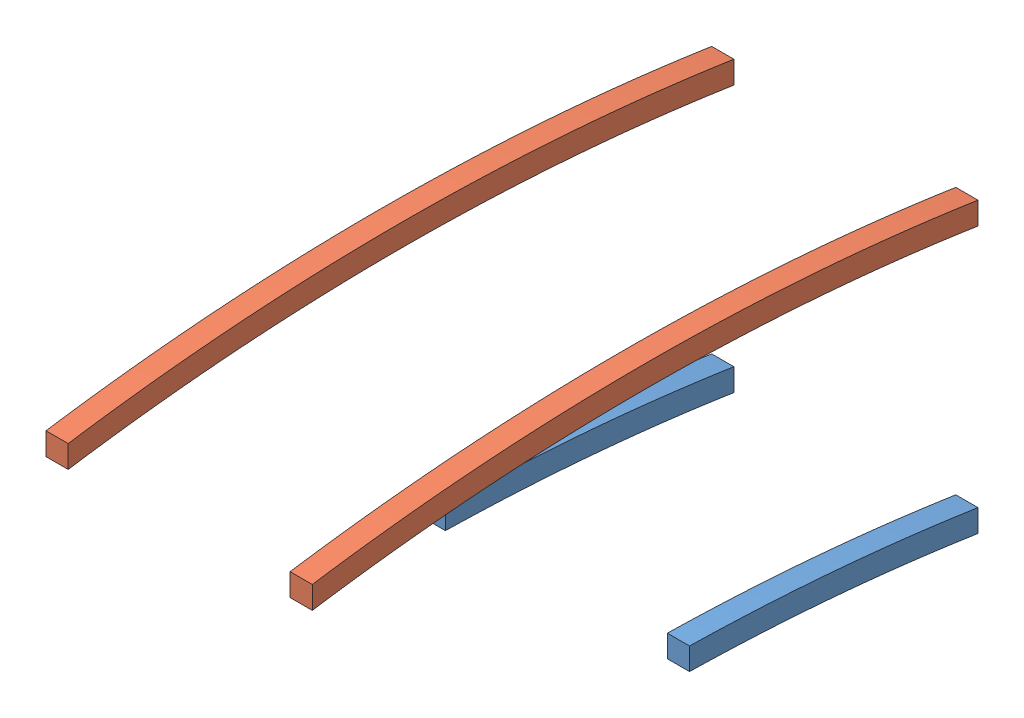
SolidWorks assembly KRZESLO.SLDASM, configuration Standard (file format 3400). Lengths in mm.
Overall size (600 2510.01 1500).
4 component instances, 2 part files, 14 mates.
Components (placement in the parent):
- NOGA 1-1: NOGA 1.SLDPRT [Standard] at (-50 -655.5798 -650) x (0 0 1) z (-1 0 0) size (1500 1910 50)
- NOGA 1-2: NOGA 1.SLDPRT [Standard] at (500 -655.5798 -650) x (0 0 1) z (-1 0 0) size (1500 1910 50)
- NOGA-1: NOGA.SLDPRT [Standard] at (-50 -55.5699 -650) x (0 0 1) z (-1 0 0) size (1500 1910 50)
- NOGA-2: NOGA.SLDPRT [Standard] at (500 -55.5699 -650) x (0 0 1) z (-1 0 0) size (1500 1910 50)
Mates (geometry in assembly coordinates):
- Parallel1: parallel anti-aligned: plane of NOGA-2 through (500 -1172.0934 100) normal (-1 0 0)
- Parallel2: parallel anti-aligned: unknown of ?
- Parallel3: parallel anti-aligned: unknown of NOGA 1-2
- Parallel5: parallel anti-aligned: unknown of NOGA 1-1
- Parallel6: parallel aligned: unknown of NOGA 1-1
- Parallel7: parallel aligned: unknown of NOGA 1-2
- Parallel8: parallel aligned: unknown of ?
- Parallel9: parallel aligned: unknown of NOGA-2
- Deckungsgleich9: coincident: point of NOGA 1-1
- Deckungsgleich11: coincident: unknown of NOGA 1-2
- Deckungsgleich12: coincident: circle of NOGA-2
- Deckungsgleich19: coincident aligned: plane of ?; plane of ?
- Deckungsgleich20: coincident aligned: plane of ?; plane of ?
- Deckungsgleich21: coincident: circle of ?; point of assembly
